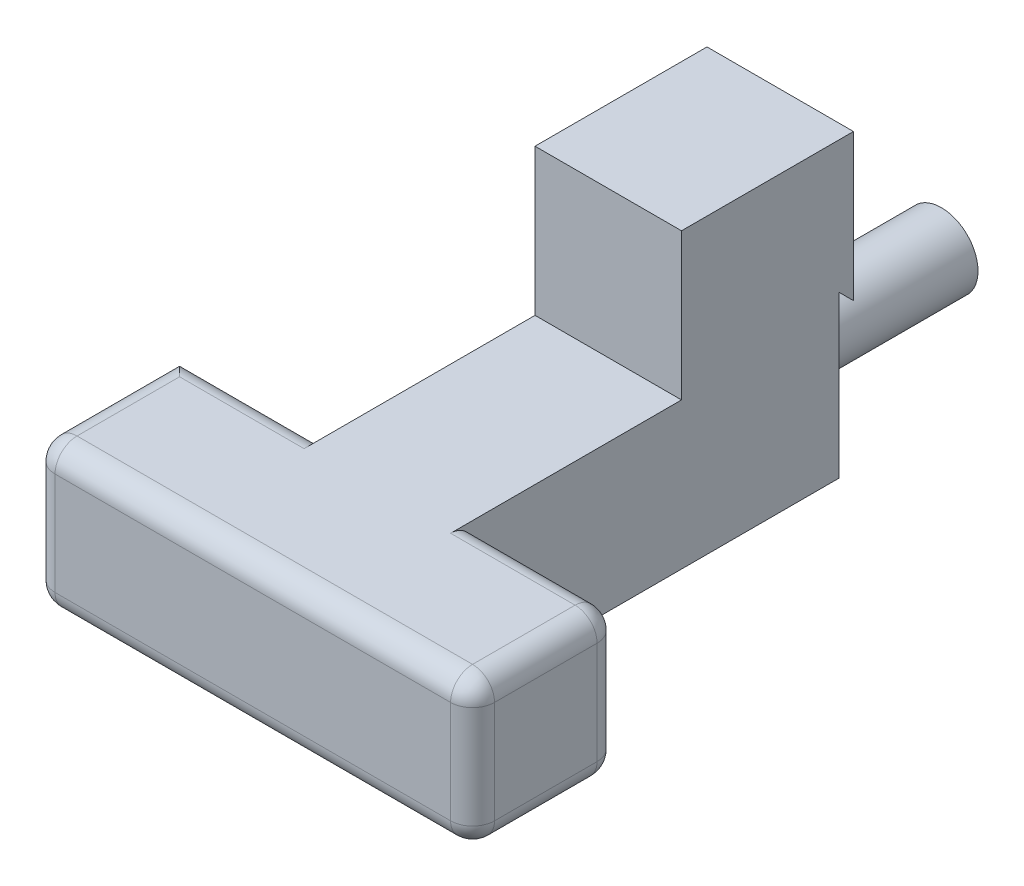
from build123d import *

# Parameters (mm, degrees)
SKETCH1_W           = 20
SKETCH1_H           = 50
BOSS_EXTRUDE1_DEPTH = 10
SKETCH2_W           = 60
SKETCH2_H           = 20
BOSS_EXTRUDE2_DEPTH = 10
SKETCH5_W           = 20
SKETCH5_H           = 23.476022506
BOSS_EXTRUDE3_DEPTH = 20
FILLET2_R           = 3
CUT_EXTRUDE2_DEPTH  = 10
SKETCH4_R           = 5
BOSS_EXTRUDE4_DEPTH = 24


with BuildPart() as part:
    # Sketch1 → Boss-Extrude1 (new, symmetric)
    with BuildSketch(Plane(origin=(0, 0, 0), x_dir=(1, 0, 0), z_dir=(0, 1, 0))):
        Rectangle(SKETCH1_W, SKETCH1_H)
    extrude(amount=BOSS_EXTRUDE1_DEPTH, both=True)

    # Sketch2 → Boss-Extrude2 (add, symmetric)
    with BuildSketch(Plane(origin=(0, 0, 0), x_dir=(1, 0, 0), z_dir=(0, 1, 0))):
        with Locations((0, -35)):
            Rectangle(SKETCH2_W, SKETCH2_H)
    extrude(amount=BOSS_EXTRUDE2_DEPTH, both=True)

    # Sketch5 → Boss-Extrude3 (add)
    with BuildSketch(Plane(origin=(0, 10, 0), x_dir=(1, 0, 0), z_dir=(0, 1, 0))):
        with Locations((0, 15.261988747)):
            Rectangle(SKETCH5_W, SKETCH5_H)
    extrude(amount=BOSS_EXTRUDE3_DEPTH)

    # Fillet2
    fillet2_edges = [part.edges().sort_by_distance(p)[0] for p in [
        (-20, -10, 25),
        (-30, -10, 35),
        (0, -10, 45),
        (-30, 0, 45),
        (30, -10, 35),
        (30, 0, 45),
        (30, 0, 25),
        (20, -10, 25),
        (-30, 10, 35),
        (0, 10, 45),
        (30, 10, 35),
        (20, 10, 25),
        (-20, 10, 25),
    ]]
    fillet(fillet2_edges, radius=FILLET2_R)

    # Sketch6 → Cut-Extrude2 (cut, symmetric)
    with BuildSketch(Plane(origin=(0, 0, 0), x_dir=(0, 0, -1), z_dir=(1, 0, 0))):
        Polygon((27, 10), (25, 10), (25, 12), align=None)
    extrude(amount=CUT_EXTRUDE2_DEPTH, both=True, mode=Mode.SUBTRACT)

    # Sketch4 → Boss-Extrude4 (add)
    with BuildSketch(Plane(origin=(0, 0, -25), x_dir=(-1, 0, 0), z_dir=(0, 0, -1))):
        with Locations(Location((0, 0, 0), (0, 0, 180))):
            Circle(SKETCH4_R)
    extrude(amount=BOSS_EXTRUDE4_DEPTH)


solid = part.part
